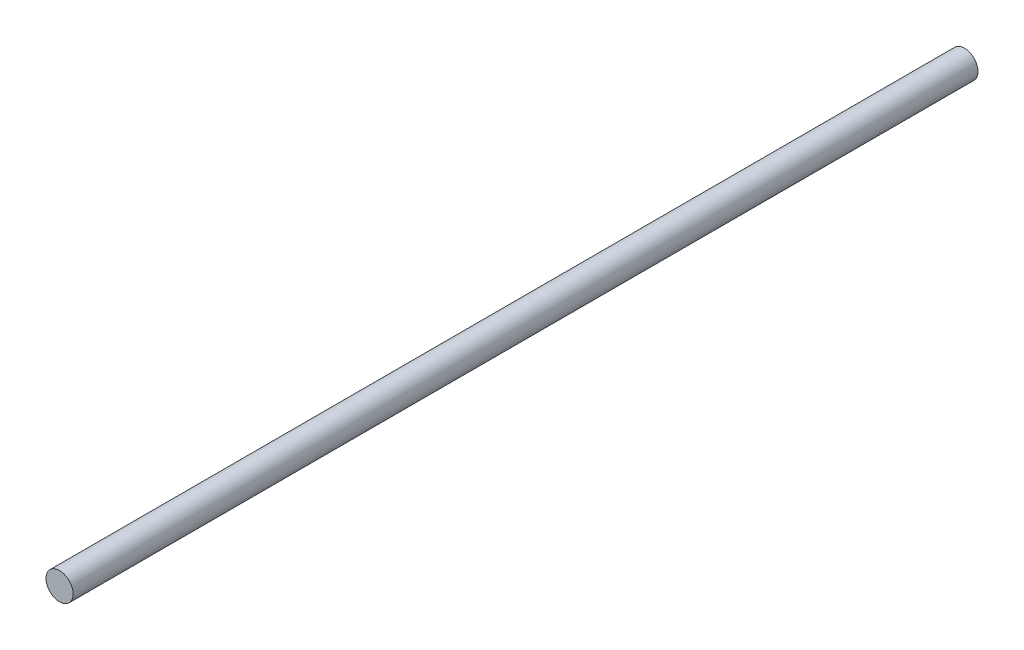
ISO-10303-21;
HEADER;
FILE_DESCRIPTION(('STEP AP214'),'2;1');
FILE_NAME('part.step','',(''),(''),'','','');
FILE_SCHEMA(('AUTOMOTIVE_DESIGN { 1 0 10303 214 1 1 1 1 }'));
ENDSEC;
DATA;
#1=APPLICATION_CONTEXT('core data for automotive mechanical design processes');
#2=APPLICATION_PROTOCOL_DEFINITION('international standard','automotive_design',2000,#1);
#3=PRODUCT_CONTEXT('',#1,'mechanical');
#4=PRODUCT('Part','Part','',(#3));
#5=PRODUCT_RELATED_PRODUCT_CATEGORY('part','',(#4));
#6=PRODUCT_DEFINITION_FORMATION('','',#4);
#7=PRODUCT_DEFINITION_CONTEXT('part definition',#1,'design');
#8=PRODUCT_DEFINITION('design','',#6,#7);
#9=PRODUCT_DEFINITION_SHAPE('','',#8);
#10=(LENGTH_UNIT() NAMED_UNIT(*) SI_UNIT(.MILLI.,.METRE.));
#11=(NAMED_UNIT(*) PLANE_ANGLE_UNIT() SI_UNIT($,.RADIAN.));
#12=(NAMED_UNIT(*) SI_UNIT($,.STERADIAN.) SOLID_ANGLE_UNIT());
#13=UNCERTAINTY_MEASURE_WITH_UNIT(LENGTH_MEASURE(1.E-05),#10,'distance_accuracy_value','');
#14=(GEOMETRIC_REPRESENTATION_CONTEXT(3) GLOBAL_UNCERTAINTY_ASSIGNED_CONTEXT((#13)) GLOBAL_UNIT_ASSIGNED_CONTEXT((#10,
#11,#12)) REPRESENTATION_CONTEXT('',''));
#15=CARTESIAN_POINT('',(0.,0.,0.));
#16=DIRECTION('',(0.,0.,1.));
#17=DIRECTION('',(1.,0.,0.));
#18=AXIS2_PLACEMENT_3D('',#15,#16,#17);
#19=CARTESIAN_POINT('',(0.,0.,-2000.));
#20=DIRECTION('',(0.,0.,1.));
#21=DIRECTION('',(1.,0.,0.));
#22=AXIS2_PLACEMENT_3D('',#19,#20,#21);
#23=CYLINDRICAL_SURFACE('',#22,30.);
#24=CARTESIAN_POINT('',(0.,0.,-2000.));
#25=DIRECTION('',(0.,0.,1.));
#26=DIRECTION('',(1.,0.,0.));
#27=AXIS2_PLACEMENT_3D('',#24,#25,#26);
#28=CIRCLE('',#27,30.);
#29=CARTESIAN_POINT('',(30.,0.,-2000.));
#30=VERTEX_POINT('',#29);
#31=EDGE_CURVE('E10',#30,#30,#28,.T.);
#32=ORIENTED_EDGE('',*,*,#31,.T.);
#33=EDGE_LOOP('',(#32));
#34=FACE_BOUND('',#33,.T.);
#35=CARTESIAN_POINT('',(0.,0.,0.));
#36=DIRECTION('',(0.,0.,1.));
#37=DIRECTION('',(1.,0.,0.));
#38=AXIS2_PLACEMENT_3D('',#35,#36,#37);
#39=CIRCLE('',#38,30.);
#40=CARTESIAN_POINT('',(30.,0.,0.));
#41=VERTEX_POINT('',#40);
#42=EDGE_CURVE('E40',#41,#41,#39,.T.);
#43=ORIENTED_EDGE('',*,*,#42,.F.);
#44=EDGE_LOOP('',(#43));
#45=FACE_BOUND('',#44,.T.);
#46=ADVANCED_FACE('F37',(#34,#45),#23,.T.);
#47=CARTESIAN_POINT('',(0.,0.,-2000.));
#48=DIRECTION('',(0.,0.,1.));
#49=DIRECTION('',(1.,0.,0.));
#50=AXIS2_PLACEMENT_3D('',#47,#48,#49);
#51=PLANE('',#50);
#52=ORIENTED_EDGE('',*,*,#31,.F.);
#53=EDGE_LOOP('',(#52));
#54=FACE_BOUND('',#53,.T.);
#55=ADVANCED_FACE('F54',(#54),#51,.F.);
#56=CARTESIAN_POINT('',(0.,0.,0.));
#57=DIRECTION('',(0.,0.,1.));
#58=DIRECTION('',(1.,0.,0.));
#59=AXIS2_PLACEMENT_3D('',#56,#57,#58);
#60=PLANE('',#59);
#61=ORIENTED_EDGE('',*,*,#42,.T.);
#62=EDGE_LOOP('',(#61));
#63=FACE_BOUND('',#62,.T.);
#64=ADVANCED_FACE('F51',(#63),#60,.T.);
#65=CLOSED_SHELL('',(#46,#55,#64));
#66=MANIFOLD_SOLID_BREP('B2',#65);
#67=ADVANCED_BREP_SHAPE_REPRESENTATION('',(#18,#66),#14);
#68=SHAPE_DEFINITION_REPRESENTATION(#9,#67);
ENDSEC;
END-ISO-10303-21;
